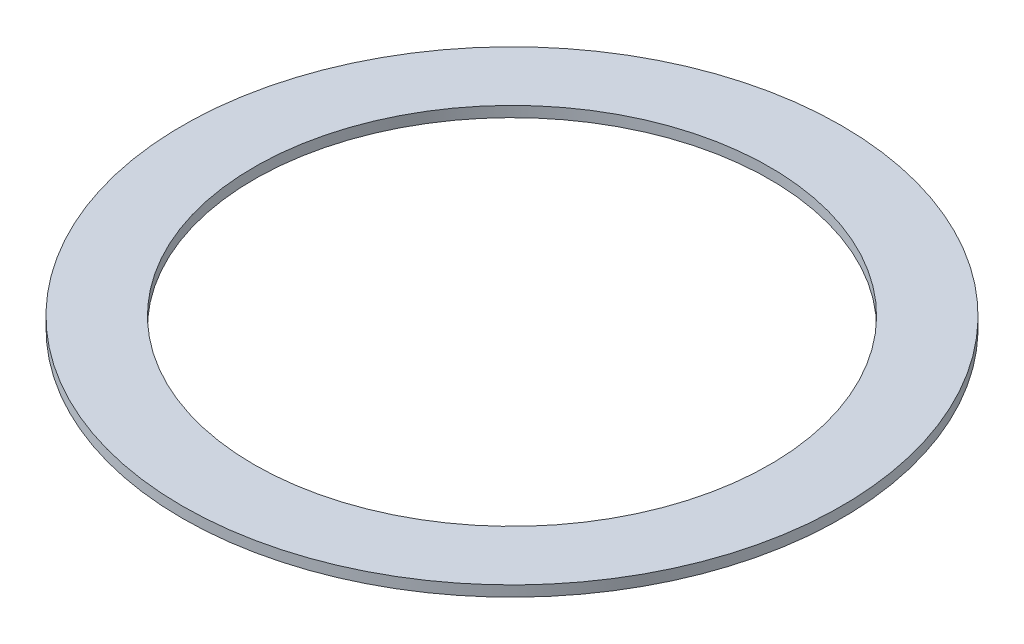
from build123d import *

# Parameters (mm, degrees)
SKETCH1_R           = 31
SKETCH1_R_2         = 24.25
BOSS_EXTRUDE1_DEPTH = 0.5


with BuildPart() as part:
    # Sketch1 → Boss-Extrude1 (new, symmetric)
    with BuildSketch(Plane(origin=(0, 0, 0), x_dir=(1, 0, 0), z_dir=(0, 1, 0))):
        with Locations(Location((0, 0, 0), (0, 0, 270))):
            Circle(SKETCH1_R)
        with Locations(Location((0, 0, 0), (0, 0, 270))):
            Circle(SKETCH1_R_2, mode=Mode.SUBTRACT)
    extrude(amount=BOSS_EXTRUDE1_DEPTH, both=True)


solid = part.part
